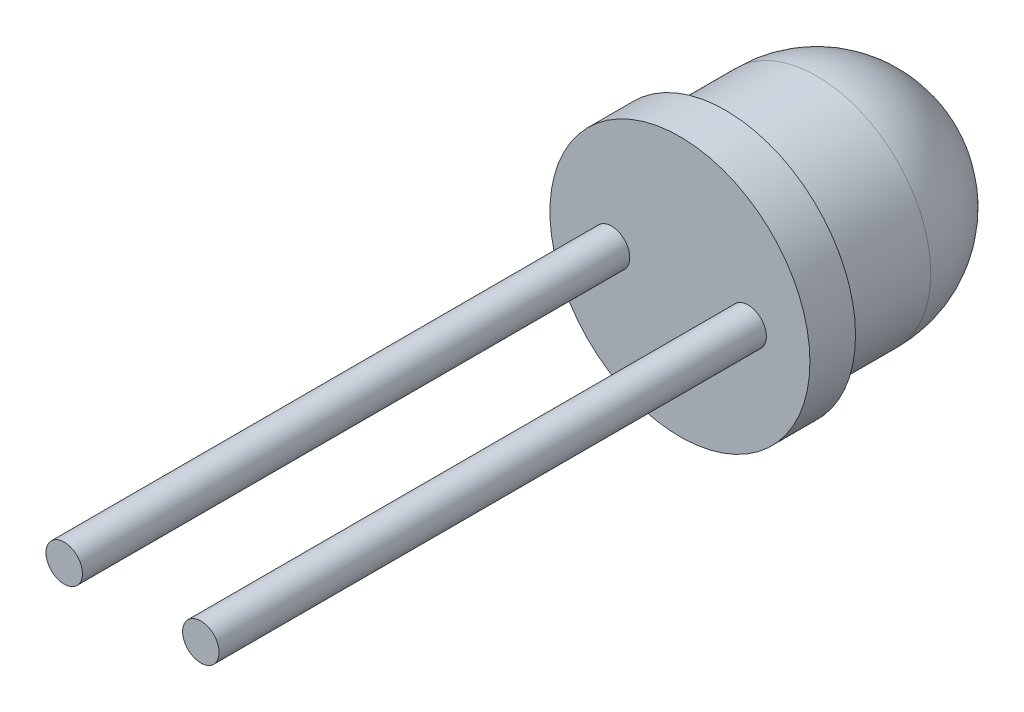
ISO-10303-21;
HEADER;
FILE_DESCRIPTION(('STEP AP214'),'2;1');
FILE_NAME('part.step','',(''),(''),'','','');
FILE_SCHEMA(('AUTOMOTIVE_DESIGN { 1 0 10303 214 1 1 1 1 }'));
ENDSEC;
DATA;
#1=APPLICATION_CONTEXT('core data for automotive mechanical design processes');
#2=APPLICATION_PROTOCOL_DEFINITION('international standard','automotive_design',2000,#1);
#3=PRODUCT_CONTEXT('',#1,'mechanical');
#4=PRODUCT('Part','Part','',(#3));
#5=PRODUCT_RELATED_PRODUCT_CATEGORY('part','',(#4));
#6=PRODUCT_DEFINITION_FORMATION('','',#4);
#7=PRODUCT_DEFINITION_CONTEXT('part definition',#1,'design');
#8=PRODUCT_DEFINITION('design','',#6,#7);
#9=PRODUCT_DEFINITION_SHAPE('','',#8);
#10=(LENGTH_UNIT() NAMED_UNIT(*) SI_UNIT(.MILLI.,.METRE.));
#11=(NAMED_UNIT(*) PLANE_ANGLE_UNIT() SI_UNIT($,.RADIAN.));
#12=(NAMED_UNIT(*) SI_UNIT($,.STERADIAN.) SOLID_ANGLE_UNIT());
#13=UNCERTAINTY_MEASURE_WITH_UNIT(LENGTH_MEASURE(1.E-05),#10,'distance_accuracy_value','');
#14=(GEOMETRIC_REPRESENTATION_CONTEXT(3) GLOBAL_UNCERTAINTY_ASSIGNED_CONTEXT((#13)) GLOBAL_UNIT_ASSIGNED_CONTEXT((#10,
#11,#12)) REPRESENTATION_CONTEXT('',''));
#15=CARTESIAN_POINT('',(0.,0.,0.));
#16=DIRECTION('',(0.,0.,1.));
#17=DIRECTION('',(1.,0.,0.));
#18=AXIS2_PLACEMENT_3D('',#15,#16,#17);
#19=CARTESIAN_POINT('',(0.,0.,5.5));
#20=DIRECTION('',(0.,0.,1.));
#21=DIRECTION('',(1.,0.,0.));
#22=AXIS2_PLACEMENT_3D('',#19,#20,#21);
#23=PLANE('',#22);
#24=CARTESIAN_POINT('',(-1.5,0.,5.5));
#25=DIRECTION('',(0.,0.,1.));
#26=DIRECTION('',(1.,0.,0.));
#27=AXIS2_PLACEMENT_3D('',#24,#25,#26);
#28=CIRCLE('',#27,0.4);
#29=CARTESIAN_POINT('',(-1.1,0.,5.5));
#30=VERTEX_POINT('',#29);
#31=EDGE_CURVE('E60',#30,#30,#28,.T.);
#32=ORIENTED_EDGE('',*,*,#31,.F.);
#33=EDGE_LOOP('',(#32));
#34=FACE_BOUND('',#33,.T.);
#35=CARTESIAN_POINT('',(0.,0.,5.5));
#36=DIRECTION('',(0.,0.,1.));
#37=DIRECTION('',(1.,0.,0.));
#38=AXIS2_PLACEMENT_3D('',#35,#36,#37);
#39=CIRCLE('',#38,2.85);
#40=CARTESIAN_POINT('',(2.85,0.,5.5));
#41=VERTEX_POINT('',#40);
#42=EDGE_CURVE('E52',#41,#41,#39,.T.);
#43=ORIENTED_EDGE('',*,*,#42,.T.);
#44=EDGE_LOOP('',(#43));
#45=FACE_BOUND('',#44,.T.);
#46=CARTESIAN_POINT('',(1.49523052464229,0.,5.5));
#47=DIRECTION('',(0.,0.,1.));
#48=DIRECTION('',(1.,0.,0.));
#49=AXIS2_PLACEMENT_3D('',#46,#47,#48);
#50=CIRCLE('',#49,0.4);
#51=CARTESIAN_POINT('',(1.89523052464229,0.,5.5));
#52=VERTEX_POINT('',#51);
#53=EDGE_CURVE('E66',#52,#52,#50,.T.);
#54=ORIENTED_EDGE('',*,*,#53,.F.);
#55=EDGE_LOOP('',(#54));
#56=FACE_BOUND('',#55,.T.);
#57=ADVANCED_FACE('F37',(#34,#45,#56),#23,.T.);
#58=CARTESIAN_POINT('',(0.,0.,5.5));
#59=DIRECTION('',(0.,0.,-1.));
#60=DIRECTION('',(-1.,0.,0.));
#61=AXIS2_PLACEMENT_3D('',#58,#59,#60);
#62=CYLINDRICAL_SURFACE('',#61,2.5);
#63=CARTESIAN_POINT('',(0.,0.,2.5));
#64=DIRECTION('',(0.,0.,-1.));
#65=DIRECTION('',(-1.,0.,0.));
#66=AXIS2_PLACEMENT_3D('',#63,#64,#65);
#67=CIRCLE('',#66,2.5);
#68=CARTESIAN_POINT('',(-2.5,0.,2.5));
#69=VERTEX_POINT('',#68);
#70=EDGE_CURVE('E44',#69,#69,#67,.F.);
#71=ORIENTED_EDGE('',*,*,#70,.T.);
#72=EDGE_LOOP('',(#71));
#73=FACE_BOUND('',#72,.T.);
#74=CARTESIAN_POINT('',(0.,0.,4.5));
#75=DIRECTION('',(0.,0.,1.));
#76=DIRECTION('',(1.,0.,0.));
#77=AXIS2_PLACEMENT_3D('',#74,#75,#76);
#78=CIRCLE('',#77,2.5);
#79=CARTESIAN_POINT('',(2.5,0.,4.5));
#80=VERTEX_POINT('',#79);
#81=EDGE_CURVE('E10',#80,#80,#78,.T.);
#82=ORIENTED_EDGE('',*,*,#81,.F.);
#83=EDGE_LOOP('',(#82));
#84=FACE_BOUND('',#83,.T.);
#85=ADVANCED_FACE('F39',(#73,#84),#62,.T.);
#86=CARTESIAN_POINT('',(0.,0.,2.5));
#87=DIRECTION('',(0.,0.,1.));
#88=DIRECTION('',(1.,0.,0.));
#89=AXIS2_PLACEMENT_3D('',#86,#87,#88);
#90=SPHERICAL_SURFACE('',#89,2.5);
#91=ORIENTED_EDGE('',*,*,#70,.F.);
#92=EDGE_LOOP('',(#91));
#93=FACE_BOUND('',#92,.T.);
#94=ADVANCED_FACE('F77',(#93),#90,.T.);
#95=CARTESIAN_POINT('',(0.,0.,4.5));
#96=DIRECTION('',(0.,0.,1.));
#97=DIRECTION('',(1.,0.,0.));
#98=AXIS2_PLACEMENT_3D('',#95,#96,#97);
#99=PLANE('',#98);
#100=CARTESIAN_POINT('',(0.,0.,4.5));
#101=DIRECTION('',(0.,0.,1.));
#102=DIRECTION('',(1.,0.,0.));
#103=AXIS2_PLACEMENT_3D('',#100,#101,#102);
#104=CIRCLE('',#103,2.85);
#105=CARTESIAN_POINT('',(2.85,0.,4.5));
#106=VERTEX_POINT('',#105);
#107=EDGE_CURVE('E48',#106,#106,#104,.T.);
#108=ORIENTED_EDGE('',*,*,#107,.F.);
#109=EDGE_LOOP('',(#108));
#110=FACE_BOUND('',#109,.T.);
#111=ORIENTED_EDGE('',*,*,#81,.T.);
#112=EDGE_LOOP('',(#111));
#113=FACE_BOUND('',#112,.T.);
#114=ADVANCED_FACE('F83',(#110,#113),#99,.F.);
#115=CARTESIAN_POINT('',(0.,0.,4.5));
#116=DIRECTION('',(0.,0.,1.));
#117=DIRECTION('',(1.,0.,0.));
#118=AXIS2_PLACEMENT_3D('',#115,#116,#117);
#119=CYLINDRICAL_SURFACE('',#118,2.85);
#120=ORIENTED_EDGE('',*,*,#107,.T.);
#121=EDGE_LOOP('',(#120));
#122=FACE_BOUND('',#121,.T.);
#123=ORIENTED_EDGE('',*,*,#42,.F.);
#124=EDGE_LOOP('',(#123));
#125=FACE_BOUND('',#124,.T.);
#126=ADVANCED_FACE('F85',(#122,#125),#119,.T.);
#127=CARTESIAN_POINT('',(-1.5,0.,17.5));
#128=DIRECTION('',(0.,0.,-1.));
#129=DIRECTION('',(-1.,0.,0.));
#130=AXIS2_PLACEMENT_3D('',#127,#128,#129);
#131=CYLINDRICAL_SURFACE('',#130,0.4);
#132=CARTESIAN_POINT('',(-1.5,0.,17.5));
#133=DIRECTION('',(0.,0.,1.));
#134=DIRECTION('',(1.,0.,0.));
#135=AXIS2_PLACEMENT_3D('',#132,#133,#134);
#136=CIRCLE('',#135,0.4);
#137=CARTESIAN_POINT('',(-1.1,0.,17.5));
#138=VERTEX_POINT('',#137);
#139=EDGE_CURVE('E57',#138,#138,#136,.T.);
#140=ORIENTED_EDGE('',*,*,#139,.F.);
#141=EDGE_LOOP('',(#140));
#142=FACE_BOUND('',#141,.T.);
#143=ORIENTED_EDGE('',*,*,#31,.T.);
#144=EDGE_LOOP('',(#143));
#145=FACE_BOUND('',#144,.T.);
#146=ADVANCED_FACE('F88',(#142,#145),#131,.T.);
#147=CARTESIAN_POINT('',(-1.5,0.,17.5));
#148=DIRECTION('',(0.,0.,1.));
#149=DIRECTION('',(1.,0.,0.));
#150=AXIS2_PLACEMENT_3D('',#147,#148,#149);
#151=PLANE('',#150);
#152=ORIENTED_EDGE('',*,*,#139,.T.);
#153=EDGE_LOOP('',(#152));
#154=FACE_BOUND('',#153,.T.);
#155=ADVANCED_FACE('F95',(#154),#151,.T.);
#156=CARTESIAN_POINT('',(1.49523052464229,0.,17.5));
#157=DIRECTION('',(0.,0.,-1.));
#158=DIRECTION('',(-1.,0.,0.));
#159=AXIS2_PLACEMENT_3D('',#156,#157,#158);
#160=CYLINDRICAL_SURFACE('',#159,0.4);
#161=CARTESIAN_POINT('',(1.49523052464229,0.,17.5));
#162=DIRECTION('',(0.,0.,1.));
#163=DIRECTION('',(1.,0.,0.));
#164=AXIS2_PLACEMENT_3D('',#161,#162,#163);
#165=CIRCLE('',#164,0.4);
#166=CARTESIAN_POINT('',(1.89523052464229,0.,17.5));
#167=VERTEX_POINT('',#166);
#168=EDGE_CURVE('E63',#167,#167,#165,.T.);
#169=ORIENTED_EDGE('',*,*,#168,.F.);
#170=EDGE_LOOP('',(#169));
#171=FACE_BOUND('',#170,.T.);
#172=ORIENTED_EDGE('',*,*,#53,.T.);
#173=EDGE_LOOP('',(#172));
#174=FACE_BOUND('',#173,.T.);
#175=ADVANCED_FACE('F70',(#171,#174),#160,.T.);
#176=CARTESIAN_POINT('',(1.49523052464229,0.,17.5));
#177=DIRECTION('',(0.,0.,1.));
#178=DIRECTION('',(1.,0.,0.));
#179=AXIS2_PLACEMENT_3D('',#176,#177,#178);
#180=PLANE('',#179);
#181=ORIENTED_EDGE('',*,*,#168,.T.);
#182=EDGE_LOOP('',(#181));
#183=FACE_BOUND('',#182,.T.);
#184=ADVANCED_FACE('F102',(#183),#180,.T.);
#185=CLOSED_SHELL('',(#57,#85,#94,#114,#126,#146,#155,#175,#184));
#186=MANIFOLD_SOLID_BREP('B2',#185);
#187=ADVANCED_BREP_SHAPE_REPRESENTATION('',(#18,#186),#14);
#188=SHAPE_DEFINITION_REPRESENTATION(#9,#187);
ENDSEC;
END-ISO-10303-21;
